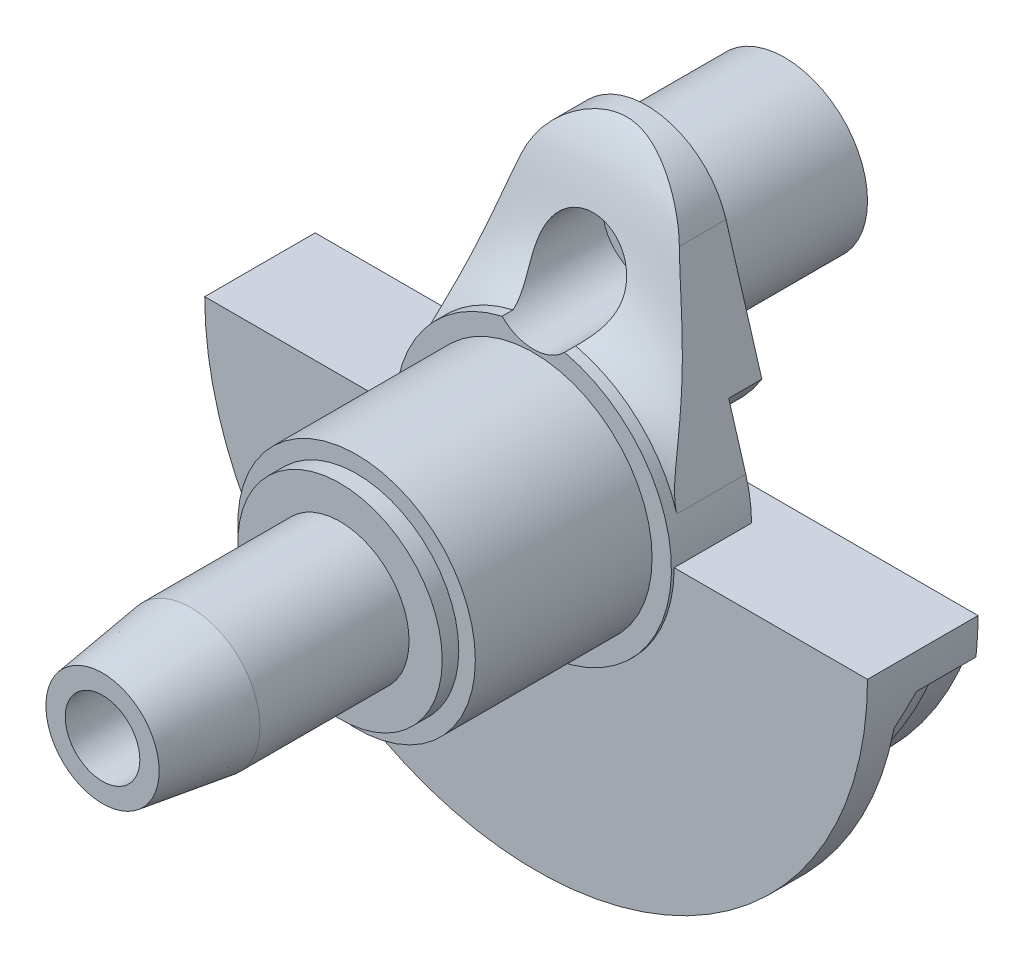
from build123d import *
from build123d.topology import SkipClean

# Parameters (mm, degrees)
BOSS_EXTRUDE1_DEPTH      = 1
BOSS_EXTRUDE1_DEPTH_BACK = 40
SKETCH1_R                = 50
BOSS_EXTRUDE2_DEPTH      = 40
SKETCH3_R                = 25
BOSS_EXTRUDE3_DEPTH      = 32
BOSS_EXTRUDE3_TAPER      = 8
SKETCH4_R                = 30
BOSS_EXTRUDE4_DEPTH      = 50
CUT_REVOLVE2_ANGLE       = 180
SKETCH5_R                = 21
CUT_EXTRUDE1_DEPTH       = 25
CUT_EXTRUDE2_REACH       = 281.435
SKETCH6_R                = 11
CUT_EXTRUDE3_START       = -41
SKETCH7_R                = 16
CUT_EXTRUDE3_DEPTH       = 41
SKETCH8_R                = 13.50269329
CUT_EXTRUDE4_DEPTH       = 30
CUT_REVOLVE1_ANGLE       = 140
CUT_EXTRUDE5_DEPTH       = 12


with BuildPart() as part:
    # Sketch1 → Boss-Extrude1 (new, two sides: drawn at the far end of the back side and taken through both)
    with BuildSketch(Plane.XY.offset(-BOSS_EXTRUDE1_DEPTH_BACK)):
        Circle(SKETCH1_R)
    extrude(amount=BOSS_EXTRUDE1_DEPTH + BOSS_EXTRUDE1_DEPTH_BACK)

    # Sketch1_3 → Boss-Extrude2 (add)
    with BuildSketch(Plane.XY):
        with BuildLine():
            ThreePointArc((50, 0), (0, -50), (-50, 0))
            Line((-50, 0), (-120, 0))
            ThreePointArc((-120, 0), (0, -120), (120, 0))
            Line((120, 0), (50, 0))
        make_face()
        with BuildLine():
            ThreePointArc((28.749445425, 78.571428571), (0, 100), (-28.749445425, 78.571428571))
            Line((-28.749445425, 78.571428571), (-47.915742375, 14.285714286))
            ThreePointArc((-47.915742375, 14.285714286), (0, 50), (47.915742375, 14.285714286))
            Line((47.915742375, 14.285714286), (28.749445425, 78.571428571))
        make_face()
    extrude(amount=-BOSS_EXTRUDE2_DEPTH)

    # Sketch2 → Revolve1 (revolve)
    with BuildSketch(Plane(origin=(0, 0, 0), x_dir=(0, 0, -1), z_dir=(1, 0, 0)), mode=Mode.PRIVATE) as revolve1_sk:
        Polygon((-1, 0), (-1, 43), (-65, 43), (-65, 37), (-71, 37), (-71, 25), (-125, 25), (-125, 0), align=None)
    revolve(revolve1_sk.sketch.rotate(Axis((0, 0, 125), (0, 0, -1)), 90), axis=Axis((0, 0, 125), (0, 0, -1)))

    # Sketch3 → Boss-Extrude3 (add)
    with BuildSketch(Plane.XY.offset(125)):
        Circle(SKETCH3_R)
    extrude(amount=BOSS_EXTRUDE3_DEPTH, taper=BOSS_EXTRUDE3_TAPER)

    # Sketch4 → Boss-Extrude4 (add)
    with BuildSketch(Plane(origin=(0, 0, -40), x_dir=(-1, 0, 0), z_dir=(0, 0, -1))):
        with Locations(Location((0, 60, 0), (0, 0, 180))):
            Circle(SKETCH4_R)
    extrude(amount=BOSS_EXTRUDE4_DEPTH)

    # Sketch12 → Cut-Revolve2 (revolve, symmetric, cut)
    with SkipClean():  # the faces are left unmerged after this step: merging them gives an invalid solid
        with BuildSketch(Plane(origin=(0, 0, 0), x_dir=(0, 0, -1), z_dir=(1, 0, 0))) as cut_revolve2_sk:
            with BuildLine():
                Line((-1, 50), (-1, 100))
                Line((-1, 100), (32.8, 100))
                add(Edge.make_bspline(
                    [(3, 50), (20, 56.187493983), (20, 78.571428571), (24, 92.971428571), (32.8, 100)],
                    knots=[0, 0, 0, 0, 0, 1, 1, 1, 1, 1], degree=4))
                Line((3, 50), (-1, 50))
            make_face()
        revolve(axis=Axis((0, 0, -40), (0, 0, 1)), revolution_arc=CUT_REVOLVE2_ANGLE / 2, mode=Mode.SUBTRACT)
        revolve(cut_revolve2_sk.sketch, axis=Axis((0, 0, -40), (0, 0, -1)), revolution_arc=CUT_REVOLVE2_ANGLE / 2, mode=Mode.SUBTRACT)

    # Sketch5 → Cut-Extrude1 (cut)
    with SkipClean():  # the faces are left unmerged after this step: merging them gives an invalid solid
        with BuildSketch(Plane(origin=(0, 0, -90), x_dir=(-1, 0, 0), z_dir=(0, 0, -1))):
            with Locations((0, 60)):
                Circle(SKETCH5_R)
        extrude(amount=-CUT_EXTRUDE1_DEPTH, mode=Mode.SUBTRACT)

    # Cut-Extrude2: up to this face of the body (flat: up to its plane)
    cut_extrude2_end = Plane(part.part.faces().sort_by_distance((0, 48.585786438, 1))[0])
    # Sketch6 → Cut-Extrude2 (cut, up to the picked face)
    with BuildSketch(Plane(origin=(0, 0, -65), x_dir=(-1, 0, 0), z_dir=(0, 0, -1)), mode=Mode.PRIVATE) as cut_extrude2_sk1:
        with Locations((0, 60)):
            Circle(SKETCH6_R)
    cut_extrude2_tool1 = split(extrude(cut_extrude2_sk1.sketch, amount=-CUT_EXTRUDE2_REACH, mode=Mode.PRIVATE), bisect_by=cut_extrude2_end, keep=Keep.BOTH, mode=Mode.PRIVATE)
    add(cut_extrude2_tool1.solids().sort_by(Axis((0, 60, -65), (0, 0, 1)))[0], mode=Mode.SUBTRACT)

    # Sketch7 → Cut-Extrude3 (cut)
    with SkipClean():  # the faces are left unmerged after this step: merging them gives an invalid solid
        with BuildSketch(Plane(origin=(0, 0, -40), x_dir=(-1, 0, 0), z_dir=(0, 0, -1)).offset(CUT_EXTRUDE3_START)):
            with Locations((0, 60)):
                Circle(SKETCH7_R)
        extrude(amount=CUT_EXTRUDE3_DEPTH, mode=Mode.SUBTRACT)

    # Sketch8 → Cut-Extrude4 (cut)
    with SkipClean():  # the faces are left unmerged after this step: merging them gives an invalid solid
        with BuildSketch(Plane.XY.offset(157)):
            Circle(SKETCH8_R)
        extrude(amount=-CUT_EXTRUDE4_DEPTH, mode=Mode.SUBTRACT)

    # Sketch9 → Cut-Revolve1 (revolve, symmetric, cut)
    with SkipClean():  # the faces are left unmerged after this step: merging them gives an invalid solid
        with BuildSketch(Plane(origin=(0, 0, 0), x_dir=(0, 0, -1), z_dir=(1, 0, 0))) as cut_revolve1_sk:
            Polygon((40, -120), (40, -94), (28, -94), (11.645736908, -99), (11.645736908, -120), align=None)
        revolve(axis=Axis((0, 30, -40), (0, 0, -1)), revolution_arc=CUT_REVOLVE1_ANGLE / 2, mode=Mode.SUBTRACT)
        revolve(cut_revolve1_sk.sketch, axis=Axis((0, 30, -40), (0, 0, 1)), revolution_arc=CUT_REVOLVE1_ANGLE / 2, mode=Mode.SUBTRACT)

    # Sketch10 → Cut-Extrude5 (cut)
    with SkipClean():  # the faces are left unmerged after this step: merging them gives an invalid solid
        with BuildSketch(Plane(origin=(0, 0, -40), x_dir=(-1, 0, 0), z_dir=(0, 0, -1))):
            with BuildLine():
                Line((-41.73993558, 35), (-47.915742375, 14.285714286))
                ThreePointArc((-47.915742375, 14.285714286), (-49.476191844, 7.218479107), (-50, 0))
                Line((-50, 0), (50, 0))
                ThreePointArc((50, 0), (49.476191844, 7.218479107), (47.915742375, 14.285714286))
                Line((47.915742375, 14.285714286), (41.73993558, 35))
                ThreePointArc((41.73993558, 35), (0, 11.345892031), (-41.73993558, 35))
            make_face()
        extrude(amount=-CUT_EXTRUDE5_DEPTH, mode=Mode.SUBTRACT)


solid = part.part
